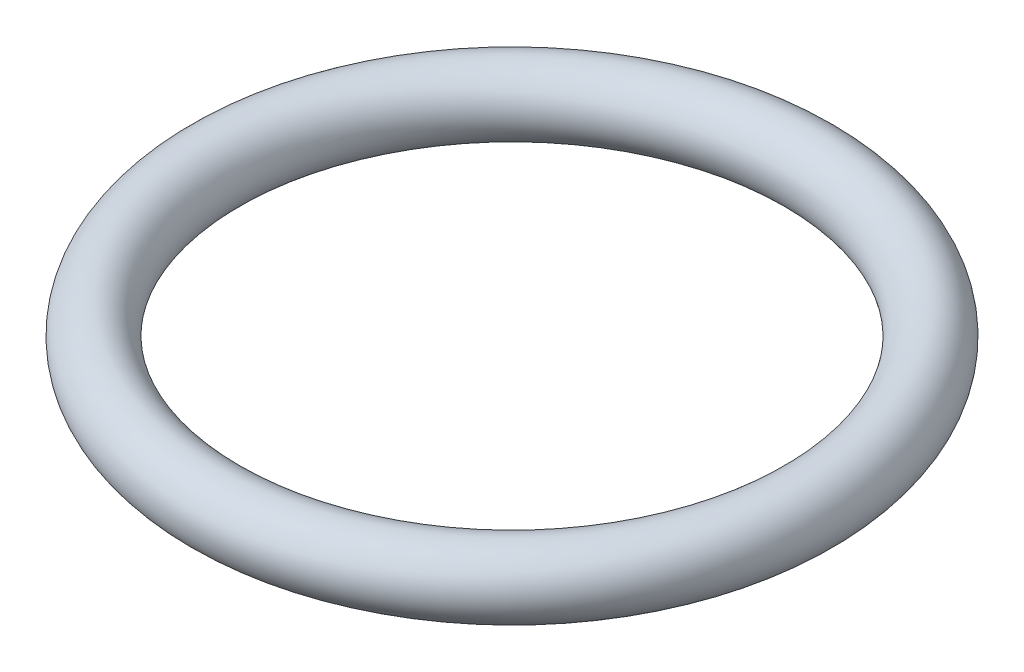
ISO-10303-21;
HEADER;
FILE_DESCRIPTION(('STEP AP214'),'2;1');
FILE_NAME('part.step','',(''),(''),'','','');
FILE_SCHEMA(('AUTOMOTIVE_DESIGN { 1 0 10303 214 1 1 1 1 }'));
ENDSEC;
DATA;
#1=APPLICATION_CONTEXT('core data for automotive mechanical design processes');
#2=APPLICATION_PROTOCOL_DEFINITION('international standard','automotive_design',2000,#1);
#3=PRODUCT_CONTEXT('',#1,'mechanical');
#4=PRODUCT('Part','Part','',(#3));
#5=PRODUCT_RELATED_PRODUCT_CATEGORY('part','',(#4));
#6=PRODUCT_DEFINITION_FORMATION('','',#4);
#7=PRODUCT_DEFINITION_CONTEXT('part definition',#1,'design');
#8=PRODUCT_DEFINITION('design','',#6,#7);
#9=PRODUCT_DEFINITION_SHAPE('','',#8);
#10=(LENGTH_UNIT() NAMED_UNIT(*) SI_UNIT(.MILLI.,.METRE.));
#11=(NAMED_UNIT(*) PLANE_ANGLE_UNIT() SI_UNIT($,.RADIAN.));
#12=(NAMED_UNIT(*) SI_UNIT($,.STERADIAN.) SOLID_ANGLE_UNIT());
#13=UNCERTAINTY_MEASURE_WITH_UNIT(LENGTH_MEASURE(1.E-05),#10,'distance_accuracy_value','');
#14=(GEOMETRIC_REPRESENTATION_CONTEXT(3) GLOBAL_UNCERTAINTY_ASSIGNED_CONTEXT((#13)) GLOBAL_UNIT_ASSIGNED_CONTEXT((#10,
#11,#12)) REPRESENTATION_CONTEXT('',''));
#15=CARTESIAN_POINT('',(0.,0.,0.));
#16=DIRECTION('',(0.,0.,1.));
#17=DIRECTION('',(1.,0.,0.));
#18=AXIS2_PLACEMENT_3D('',#15,#16,#17);
#19=CARTESIAN_POINT('',(0.,0.,0.));
#20=DIRECTION('',(0.,-1.,0.));
#21=DIRECTION('',(0.,0.,-1.));
#22=AXIS2_PLACEMENT_3D('',#19,#20,#21);
#23=TOROIDAL_SURFACE('',#22,23.35,2.65);
#24=CARTESIAN_POINT('',(0.,0.,-26.));
#25=VERTEX_POINT('',#24);
#26=VERTEX_LOOP('',#25);
#27=FACE_BOUND('',#26,.T.);
#28=ADVANCED_FACE('F22',(#27),#23,.T.);
#29=CLOSED_SHELL('',(#28));
#30=MANIFOLD_SOLID_BREP('B2',#29);
#31=ADVANCED_BREP_SHAPE_REPRESENTATION('',(#18,#30),#14);
#32=SHAPE_DEFINITION_REPRESENTATION(#9,#31);
ENDSEC;
END-ISO-10303-21;
